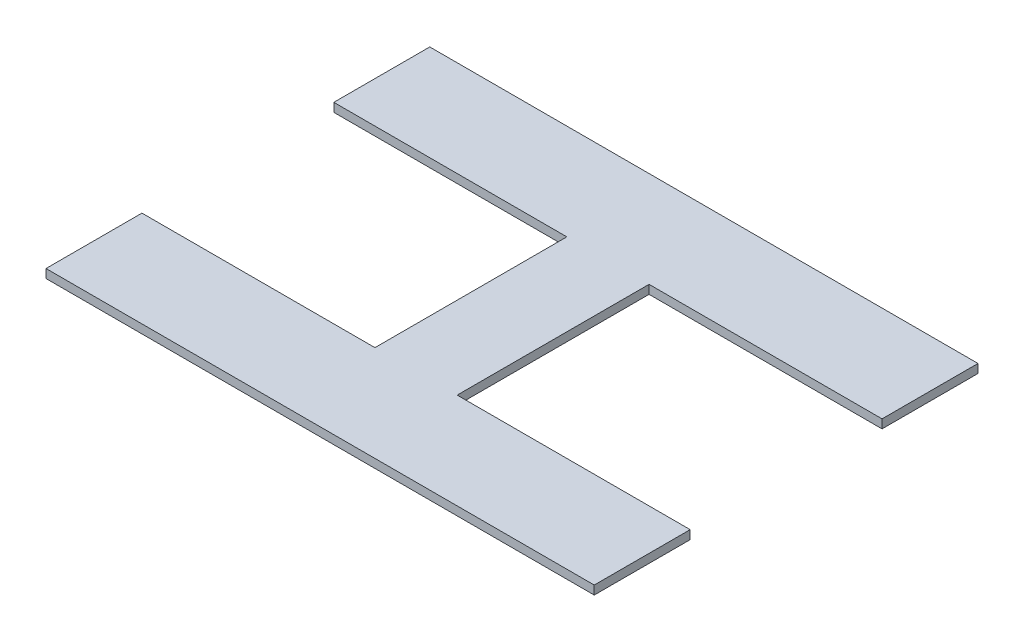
ISO-10303-21;
HEADER;
FILE_DESCRIPTION(('STEP AP214'),'2;1');
FILE_NAME('part.step','',(''),(''),'','','');
FILE_SCHEMA(('AUTOMOTIVE_DESIGN { 1 0 10303 214 1 1 1 1 }'));
ENDSEC;
DATA;
#1=APPLICATION_CONTEXT('core data for automotive mechanical design processes');
#2=APPLICATION_PROTOCOL_DEFINITION('international standard','automotive_design',2000,#1);
#3=PRODUCT_CONTEXT('',#1,'mechanical');
#4=PRODUCT('Part','Part','',(#3));
#5=PRODUCT_RELATED_PRODUCT_CATEGORY('part','',(#4));
#6=PRODUCT_DEFINITION_FORMATION('','',#4);
#7=PRODUCT_DEFINITION_CONTEXT('part definition',#1,'design');
#8=PRODUCT_DEFINITION('design','',#6,#7);
#9=PRODUCT_DEFINITION_SHAPE('','',#8);
#10=(LENGTH_UNIT() NAMED_UNIT(*) SI_UNIT(.MILLI.,.METRE.));
#11=(NAMED_UNIT(*) PLANE_ANGLE_UNIT() SI_UNIT($,.RADIAN.));
#12=(NAMED_UNIT(*) SI_UNIT($,.STERADIAN.) SOLID_ANGLE_UNIT());
#13=UNCERTAINTY_MEASURE_WITH_UNIT(LENGTH_MEASURE(1.E-05),#10,'distance_accuracy_value','');
#14=(GEOMETRIC_REPRESENTATION_CONTEXT(3) GLOBAL_UNCERTAINTY_ASSIGNED_CONTEXT((#13)) GLOBAL_UNIT_ASSIGNED_CONTEXT((#10,
#11,#12)) REPRESENTATION_CONTEXT('',''));
#15=CARTESIAN_POINT('',(0.,0.,0.));
#16=DIRECTION('',(0.,0.,1.));
#17=DIRECTION('',(1.,0.,0.));
#18=AXIS2_PLACEMENT_3D('',#15,#16,#17);
#19=CARTESIAN_POINT('',(0.,3.175,0.));
#20=DIRECTION('',(1.,0.,0.));
#21=DIRECTION('',(0.,0.,-1.));
#22=AXIS2_PLACEMENT_3D('',#19,#20,#21);
#23=PLANE('',#22);
#24=DIRECTION('',(0.,0.,1.));
#25=VECTOR('',#24,1.);
#26=CARTESIAN_POINT('',(0.,0.,0.));
#27=LINE('',#26,#25);
#28=CARTESIAN_POINT('',(0.,0.,-140.));
#29=VERTEX_POINT('',#28);
#30=CARTESIAN_POINT('',(0.,0.,-105.));
#31=VERTEX_POINT('',#30);
#32=EDGE_CURVE('E154',#29,#31,#27,.T.);
#33=ORIENTED_EDGE('',*,*,#32,.T.);
#34=DIRECTION('',(0.,1.,0.));
#35=VECTOR('',#34,1.);
#36=CARTESIAN_POINT('',(0.,0.,-105.));
#37=LINE('',#36,#35);
#38=CARTESIAN_POINT('',(0.,3.175,-105.));
#39=VERTEX_POINT('',#38);
#40=EDGE_CURVE('E155',#31,#39,#37,.T.);
#41=ORIENTED_EDGE('',*,*,#40,.T.);
#42=DIRECTION('',(0.,0.,1.));
#43=VECTOR('',#42,1.);
#44=CARTESIAN_POINT('',(0.,3.175,0.));
#45=LINE('',#44,#43);
#46=CARTESIAN_POINT('',(0.,3.175,-140.));
#47=VERTEX_POINT('',#46);
#48=EDGE_CURVE('E233',#47,#39,#45,.T.);
#49=ORIENTED_EDGE('',*,*,#48,.F.);
#50=DIRECTION('',(0.,-1.,0.));
#51=VECTOR('',#50,1.);
#52=CARTESIAN_POINT('',(0.,3.175,-140.));
#53=LINE('',#52,#51);
#54=EDGE_CURVE('E177',#47,#29,#53,.T.);
#55=ORIENTED_EDGE('',*,*,#54,.T.);
#56=EDGE_LOOP('',(#33,#41,#49,#55));
#57=FACE_BOUND('',#56,.T.);
#58=ADVANCED_FACE('F39',(#57),#23,.F.);
#59=CARTESIAN_POINT('',(200.,3.175,0.));
#60=DIRECTION('',(-1.,0.,0.));
#61=DIRECTION('',(0.,0.,1.));
#62=AXIS2_PLACEMENT_3D('',#59,#60,#61);
#63=PLANE('',#62);
#64=DIRECTION('',(0.,0.,-1.));
#65=VECTOR('',#64,1.);
#66=CARTESIAN_POINT('',(200.,0.,0.));
#67=LINE('',#66,#65);
#68=CARTESIAN_POINT('',(200.,0.,0.));
#69=VERTEX_POINT('',#68);
#70=CARTESIAN_POINT('',(200.,0.,-35.0000000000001));
#71=VERTEX_POINT('',#70);
#72=EDGE_CURVE('E170',#69,#71,#67,.T.);
#73=ORIENTED_EDGE('',*,*,#72,.T.);
#74=DIRECTION('',(0.,1.,0.));
#75=VECTOR('',#74,1.);
#76=CARTESIAN_POINT('',(200.,0.,-35.0000000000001));
#77=LINE('',#76,#75);
#78=CARTESIAN_POINT('',(200.,3.175,-35.0000000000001));
#79=VERTEX_POINT('',#78);
#80=EDGE_CURVE('E214',#71,#79,#77,.T.);
#81=ORIENTED_EDGE('',*,*,#80,.T.);
#82=DIRECTION('',(0.,0.,-1.));
#83=VECTOR('',#82,1.);
#84=CARTESIAN_POINT('',(200.,3.175,0.));
#85=LINE('',#84,#83);
#86=CARTESIAN_POINT('',(200.,3.175,0.));
#87=VERTEX_POINT('',#86);
#88=EDGE_CURVE('E192',#87,#79,#85,.T.);
#89=ORIENTED_EDGE('',*,*,#88,.F.);
#90=DIRECTION('',(0.,-1.,0.));
#91=VECTOR('',#90,1.);
#92=CARTESIAN_POINT('',(200.,3.175,0.));
#93=LINE('',#92,#91);
#94=EDGE_CURVE('E48',#87,#69,#93,.T.);
#95=ORIENTED_EDGE('',*,*,#94,.T.);
#96=EDGE_LOOP('',(#73,#81,#89,#95));
#97=FACE_BOUND('',#96,.T.);
#98=ADVANCED_FACE('F189',(#97),#63,.F.);
#99=CARTESIAN_POINT('',(0.,3.175,-35.));
#100=VERTEX_POINT('',#99);
#101=CARTESIAN_POINT('',(0.,3.175,0.));
#102=VERTEX_POINT('',#101);
#103=EDGE_CURVE('E145',#100,#102,#45,.T.);
#104=ORIENTED_EDGE('',*,*,#103,.F.);
#105=DIRECTION('',(0.,1.,0.));
#106=VECTOR('',#105,1.);
#107=CARTESIAN_POINT('',(0.,0.,-35.));
#108=LINE('',#107,#106);
#109=CARTESIAN_POINT('',(0.,0.,-35.));
#110=VERTEX_POINT('',#109);
#111=EDGE_CURVE('E132',#110,#100,#108,.T.);
#112=ORIENTED_EDGE('',*,*,#111,.F.);
#113=CARTESIAN_POINT('',(0.,0.,0.));
#114=VERTEX_POINT('',#113);
#115=EDGE_CURVE('E143',#110,#114,#27,.T.);
#116=ORIENTED_EDGE('',*,*,#115,.T.);
#117=DIRECTION('',(0.,-1.,0.));
#118=VECTOR('',#117,1.);
#119=CARTESIAN_POINT('',(0.,3.175,0.));
#120=LINE('',#119,#118);
#121=EDGE_CURVE('E11',#102,#114,#120,.T.);
#122=ORIENTED_EDGE('',*,*,#121,.F.);
#123=EDGE_LOOP('',(#104,#112,#116,#122));
#124=FACE_BOUND('',#123,.T.);
#125=ADVANCED_FACE('F41',(#124),#23,.F.);
#126=CARTESIAN_POINT('',(0.,3.175,0.));
#127=DIRECTION('',(0.,0.,-1.));
#128=DIRECTION('',(-1.,0.,0.));
#129=AXIS2_PLACEMENT_3D('',#126,#127,#128);
#130=PLANE('',#129);
#131=DIRECTION('',(1.,0.,0.));
#132=VECTOR('',#131,1.);
#133=CARTESIAN_POINT('',(0.,0.,0.));
#134=LINE('',#133,#132);
#135=EDGE_CURVE('E152',#114,#69,#134,.T.);
#136=ORIENTED_EDGE('',*,*,#135,.T.);
#137=ORIENTED_EDGE('',*,*,#94,.F.);
#138=DIRECTION('',(1.,0.,0.));
#139=VECTOR('',#138,1.);
#140=CARTESIAN_POINT('',(0.,3.175,0.));
#141=LINE('',#140,#139);
#142=EDGE_CURVE('E237',#102,#87,#141,.T.);
#143=ORIENTED_EDGE('',*,*,#142,.F.);
#144=ORIENTED_EDGE('',*,*,#121,.T.);
#145=EDGE_LOOP('',(#136,#137,#143,#144));
#146=FACE_BOUND('',#145,.T.);
#147=ADVANCED_FACE('F300',(#146),#130,.F.);
#148=CARTESIAN_POINT('',(200.,3.175,-105.));
#149=VERTEX_POINT('',#148);
#150=CARTESIAN_POINT('',(200.,3.175,-140.));
#151=VERTEX_POINT('',#150);
#152=EDGE_CURVE('E239',#149,#151,#85,.T.);
#153=ORIENTED_EDGE('',*,*,#152,.F.);
#154=DIRECTION('',(0.,1.,0.));
#155=VECTOR('',#154,1.);
#156=CARTESIAN_POINT('',(200.,0.,-105.));
#157=LINE('',#156,#155);
#158=CARTESIAN_POINT('',(200.,0.,-105.));
#159=VERTEX_POINT('',#158);
#160=EDGE_CURVE('E228',#159,#149,#157,.T.);
#161=ORIENTED_EDGE('',*,*,#160,.F.);
#162=CARTESIAN_POINT('',(200.,0.,-140.));
#163=VERTEX_POINT('',#162);
#164=EDGE_CURVE('E169',#159,#163,#67,.T.);
#165=ORIENTED_EDGE('',*,*,#164,.T.);
#166=DIRECTION('',(0.,-1.,0.));
#167=VECTOR('',#166,1.);
#168=CARTESIAN_POINT('',(200.,3.175,-140.));
#169=LINE('',#168,#167);
#170=EDGE_CURVE('E181',#151,#163,#169,.T.);
#171=ORIENTED_EDGE('',*,*,#170,.F.);
#172=EDGE_LOOP('',(#153,#161,#165,#171));
#173=FACE_BOUND('',#172,.T.);
#174=ADVANCED_FACE('F254',(#173),#63,.F.);
#175=CARTESIAN_POINT('',(0.,3.175,-140.));
#176=DIRECTION('',(0.,0.,1.));
#177=DIRECTION('',(1.,0.,0.));
#178=AXIS2_PLACEMENT_3D('',#175,#176,#177);
#179=PLANE('',#178);
#180=DIRECTION('',(-1.,0.,0.));
#181=VECTOR('',#180,1.);
#182=CARTESIAN_POINT('',(0.,0.,-140.));
#183=LINE('',#182,#181);
#184=EDGE_CURVE('E174',#163,#29,#183,.T.);
#185=ORIENTED_EDGE('',*,*,#184,.T.);
#186=ORIENTED_EDGE('',*,*,#54,.F.);
#187=DIRECTION('',(-1.,0.,0.));
#188=VECTOR('',#187,1.);
#189=CARTESIAN_POINT('',(0.,3.175,-140.));
#190=LINE('',#189,#188);
#191=EDGE_CURVE('E165',#151,#47,#190,.T.);
#192=ORIENTED_EDGE('',*,*,#191,.F.);
#193=ORIENTED_EDGE('',*,*,#170,.T.);
#194=EDGE_LOOP('',(#185,#186,#192,#193));
#195=FACE_BOUND('',#194,.T.);
#196=ADVANCED_FACE('F258',(#195),#179,.F.);
#197=CARTESIAN_POINT('',(0.,3.175,0.));
#198=DIRECTION('',(0.,-1.,0.));
#199=DIRECTION('',(0.,0.,-1.));
#200=AXIS2_PLACEMENT_3D('',#197,#198,#199);
#201=PLANE('',#200);
#202=ORIENTED_EDGE('',*,*,#48,.T.);
#203=DIRECTION('',(-1.,0.,0.));
#204=VECTOR('',#203,1.);
#205=CARTESIAN_POINT('',(0.,3.175,-105.));
#206=LINE('',#205,#204);
#207=CARTESIAN_POINT('',(85.,3.175,-105.));
#208=VERTEX_POINT('',#207);
#209=EDGE_CURVE('E138',#208,#39,#206,.T.);
#210=ORIENTED_EDGE('',*,*,#209,.F.);
#211=DIRECTION('',(0.,0.,-1.));
#212=VECTOR('',#211,1.);
#213=CARTESIAN_POINT('',(85.,3.175,-35.));
#214=LINE('',#213,#212);
#215=CARTESIAN_POINT('',(85.,3.175,-35.));
#216=VERTEX_POINT('',#215);
#217=EDGE_CURVE('E265',#216,#208,#214,.T.);
#218=ORIENTED_EDGE('',*,*,#217,.F.);
#219=DIRECTION('',(1.,0.,0.));
#220=VECTOR('',#219,1.);
#221=CARTESIAN_POINT('',(0.,3.175,-35.));
#222=LINE('',#221,#220);
#223=EDGE_CURVE('E224',#100,#216,#222,.T.);
#224=ORIENTED_EDGE('',*,*,#223,.F.);
#225=ORIENTED_EDGE('',*,*,#103,.T.);
#226=ORIENTED_EDGE('',*,*,#142,.T.);
#227=ORIENTED_EDGE('',*,*,#88,.T.);
#228=DIRECTION('',(1.,0.,0.));
#229=VECTOR('',#228,1.);
#230=CARTESIAN_POINT('',(200.,3.175,-35.0000000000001));
#231=LINE('',#230,#229);
#232=CARTESIAN_POINT('',(115.,3.175,-35.));
#233=VERTEX_POINT('',#232);
#234=EDGE_CURVE('E215',#233,#79,#231,.T.);
#235=ORIENTED_EDGE('',*,*,#234,.F.);
#236=DIRECTION('',(0.,0.,1.));
#237=VECTOR('',#236,1.);
#238=CARTESIAN_POINT('',(115.,3.175,-35.));
#239=LINE('',#238,#237);
#240=CARTESIAN_POINT('',(115.,3.175,-105.));
#241=VERTEX_POINT('',#240);
#242=EDGE_CURVE('E202',#241,#233,#239,.T.);
#243=ORIENTED_EDGE('',*,*,#242,.F.);
#244=DIRECTION('',(-1.,0.,0.));
#245=VECTOR('',#244,1.);
#246=CARTESIAN_POINT('',(200.,3.175,-105.));
#247=LINE('',#246,#245);
#248=EDGE_CURVE('E208',#149,#241,#247,.T.);
#249=ORIENTED_EDGE('',*,*,#248,.F.);
#250=ORIENTED_EDGE('',*,*,#152,.T.);
#251=ORIENTED_EDGE('',*,*,#191,.T.);
#252=EDGE_LOOP('',(#202,#210,#218,#224,#225,#226,#227,#235,#243,#249,#250,#251));
#253=FACE_BOUND('',#252,.T.);
#254=ADVANCED_FACE('F248',(#253),#201,.F.);
#255=CARTESIAN_POINT('',(0.,0.,0.));
#256=DIRECTION('',(0.,-1.,0.));
#257=DIRECTION('',(0.,0.,-1.));
#258=AXIS2_PLACEMENT_3D('',#255,#256,#257);
#259=PLANE('',#258);
#260=DIRECTION('',(-1.,0.,0.));
#261=VECTOR('',#260,1.);
#262=CARTESIAN_POINT('',(0.,0.,-105.));
#263=LINE('',#262,#261);
#264=CARTESIAN_POINT('',(85.,0.,-105.));
#265=VERTEX_POINT('',#264);
#266=EDGE_CURVE('E147',#265,#31,#263,.T.);
#267=ORIENTED_EDGE('',*,*,#266,.T.);
#268=ORIENTED_EDGE('',*,*,#32,.F.);
#269=ORIENTED_EDGE('',*,*,#184,.F.);
#270=ORIENTED_EDGE('',*,*,#164,.F.);
#271=DIRECTION('',(-1.,0.,0.));
#272=VECTOR('',#271,1.);
#273=CARTESIAN_POINT('',(200.,0.,-105.));
#274=LINE('',#273,#272);
#275=CARTESIAN_POINT('',(115.,0.,-105.));
#276=VERTEX_POINT('',#275);
#277=EDGE_CURVE('E201',#159,#276,#274,.T.);
#278=ORIENTED_EDGE('',*,*,#277,.T.);
#279=DIRECTION('',(0.,0.,1.));
#280=VECTOR('',#279,1.);
#281=CARTESIAN_POINT('',(115.,0.,-35.));
#282=LINE('',#281,#280);
#283=CARTESIAN_POINT('',(115.,0.,-35.));
#284=VERTEX_POINT('',#283);
#285=EDGE_CURVE('E63',#276,#284,#282,.T.);
#286=ORIENTED_EDGE('',*,*,#285,.T.);
#287=DIRECTION('',(1.,0.,0.));
#288=VECTOR('',#287,1.);
#289=CARTESIAN_POINT('',(200.,0.,-35.0000000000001));
#290=LINE('',#289,#288);
#291=EDGE_CURVE('E197',#284,#71,#290,.T.);
#292=ORIENTED_EDGE('',*,*,#291,.T.);
#293=ORIENTED_EDGE('',*,*,#72,.F.);
#294=ORIENTED_EDGE('',*,*,#135,.F.);
#295=ORIENTED_EDGE('',*,*,#115,.F.);
#296=DIRECTION('',(1.,0.,0.));
#297=VECTOR('',#296,1.);
#298=CARTESIAN_POINT('',(0.,0.,-35.));
#299=LINE('',#298,#297);
#300=CARTESIAN_POINT('',(85.,0.,-35.));
#301=VERTEX_POINT('',#300);
#302=EDGE_CURVE('E128',#110,#301,#299,.T.);
#303=ORIENTED_EDGE('',*,*,#302,.T.);
#304=DIRECTION('',(0.,0.,-1.));
#305=VECTOR('',#304,1.);
#306=CARTESIAN_POINT('',(85.,0.,-35.));
#307=LINE('',#306,#305);
#308=EDGE_CURVE('E55',#301,#265,#307,.T.);
#309=ORIENTED_EDGE('',*,*,#308,.T.);
#310=EDGE_LOOP('',(#267,#268,#269,#270,#278,#286,#292,#293,#294,#295,#303,#309));
#311=FACE_BOUND('',#310,.T.);
#312=ADVANCED_FACE('F150',(#311),#259,.T.);
#313=CARTESIAN_POINT('',(200.,0.,-35.0000000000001));
#314=DIRECTION('',(0.,0.,1.));
#315=DIRECTION('',(1.,0.,0.));
#316=AXIS2_PLACEMENT_3D('',#313,#314,#315);
#317=PLANE('',#316);
#318=ORIENTED_EDGE('',*,*,#234,.T.);
#319=ORIENTED_EDGE('',*,*,#80,.F.);
#320=ORIENTED_EDGE('',*,*,#291,.F.);
#321=DIRECTION('',(0.,1.,0.));
#322=VECTOR('',#321,1.);
#323=CARTESIAN_POINT('',(115.,0.,-35.));
#324=LINE('',#323,#322);
#325=EDGE_CURVE('E221',#284,#233,#324,.T.);
#326=ORIENTED_EDGE('',*,*,#325,.T.);
#327=EDGE_LOOP('',(#318,#319,#320,#326));
#328=FACE_BOUND('',#327,.T.);
#329=ADVANCED_FACE('F312',(#328),#317,.F.);
#330=CARTESIAN_POINT('',(115.,0.,-35.));
#331=DIRECTION('',(-1.,0.,0.));
#332=DIRECTION('',(0.,0.,1.));
#333=AXIS2_PLACEMENT_3D('',#330,#331,#332);
#334=PLANE('',#333);
#335=ORIENTED_EDGE('',*,*,#242,.T.);
#336=ORIENTED_EDGE('',*,*,#325,.F.);
#337=ORIENTED_EDGE('',*,*,#285,.F.);
#338=DIRECTION('',(0.,1.,0.));
#339=VECTOR('',#338,1.);
#340=CARTESIAN_POINT('',(115.,0.,-105.));
#341=LINE('',#340,#339);
#342=EDGE_CURVE('E225',#276,#241,#341,.T.);
#343=ORIENTED_EDGE('',*,*,#342,.T.);
#344=EDGE_LOOP('',(#335,#336,#337,#343));
#345=FACE_BOUND('',#344,.T.);
#346=ADVANCED_FACE('F291',(#345),#334,.F.);
#347=CARTESIAN_POINT('',(200.,0.,-105.));
#348=DIRECTION('',(0.,0.,-1.));
#349=DIRECTION('',(-1.,0.,0.));
#350=AXIS2_PLACEMENT_3D('',#347,#348,#349);
#351=PLANE('',#350);
#352=ORIENTED_EDGE('',*,*,#248,.T.);
#353=ORIENTED_EDGE('',*,*,#342,.F.);
#354=ORIENTED_EDGE('',*,*,#277,.F.);
#355=ORIENTED_EDGE('',*,*,#160,.T.);
#356=EDGE_LOOP('',(#352,#353,#354,#355));
#357=FACE_BOUND('',#356,.T.);
#358=ADVANCED_FACE('F284',(#357),#351,.F.);
#359=CARTESIAN_POINT('',(0.,0.,-105.));
#360=DIRECTION('',(0.,0.,-1.));
#361=DIRECTION('',(-1.,0.,0.));
#362=AXIS2_PLACEMENT_3D('',#359,#360,#361);
#363=PLANE('',#362);
#364=ORIENTED_EDGE('',*,*,#209,.T.);
#365=ORIENTED_EDGE('',*,*,#40,.F.);
#366=ORIENTED_EDGE('',*,*,#266,.F.);
#367=DIRECTION('',(0.,1.,0.));
#368=VECTOR('',#367,1.);
#369=CARTESIAN_POINT('',(85.,0.,-105.));
#370=LINE('',#369,#368);
#371=EDGE_CURVE('E161',#265,#208,#370,.T.);
#372=ORIENTED_EDGE('',*,*,#371,.T.);
#373=EDGE_LOOP('',(#364,#365,#366,#372));
#374=FACE_BOUND('',#373,.T.);
#375=ADVANCED_FACE('F282',(#374),#363,.F.);
#376=CARTESIAN_POINT('',(85.,0.,-35.));
#377=DIRECTION('',(1.,0.,0.));
#378=DIRECTION('',(0.,0.,-1.));
#379=AXIS2_PLACEMENT_3D('',#376,#377,#378);
#380=PLANE('',#379);
#381=ORIENTED_EDGE('',*,*,#217,.T.);
#382=ORIENTED_EDGE('',*,*,#371,.F.);
#383=ORIENTED_EDGE('',*,*,#308,.F.);
#384=DIRECTION('',(0.,1.,0.));
#385=VECTOR('',#384,1.);
#386=CARTESIAN_POINT('',(85.,0.,-35.));
#387=LINE('',#386,#385);
#388=EDGE_CURVE('E134',#301,#216,#387,.T.);
#389=ORIENTED_EDGE('',*,*,#388,.T.);
#390=EDGE_LOOP('',(#381,#382,#383,#389));
#391=FACE_BOUND('',#390,.T.);
#392=ADVANCED_FACE('F275',(#391),#380,.F.);
#393=CARTESIAN_POINT('',(0.,0.,-35.));
#394=DIRECTION('',(0.,0.,1.));
#395=DIRECTION('',(1.,0.,0.));
#396=AXIS2_PLACEMENT_3D('',#393,#394,#395);
#397=PLANE('',#396);
#398=ORIENTED_EDGE('',*,*,#223,.T.);
#399=ORIENTED_EDGE('',*,*,#388,.F.);
#400=ORIENTED_EDGE('',*,*,#302,.F.);
#401=ORIENTED_EDGE('',*,*,#111,.T.);
#402=EDGE_LOOP('',(#398,#399,#400,#401));
#403=FACE_BOUND('',#402,.T.);
#404=ADVANCED_FACE('F131',(#403),#397,.F.);
#405=CLOSED_SHELL('',(#58,#98,#125,#147,#174,#196,#254,#312,#329,#346,#358,#375,#392,#404));
#406=MANIFOLD_SOLID_BREP('B2',#405);
#407=ADVANCED_BREP_SHAPE_REPRESENTATION('',(#18,#406),#14);
#408=SHAPE_DEFINITION_REPRESENTATION(#9,#407);
ENDSEC;
END-ISO-10303-21;
